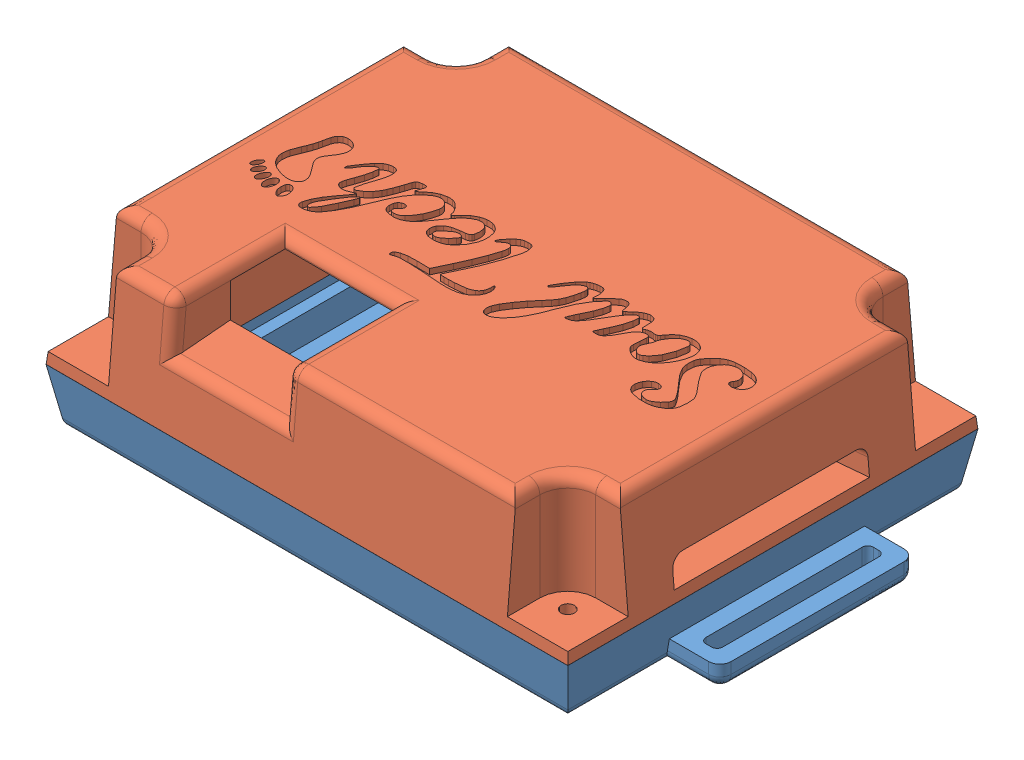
SolidWorks assembly casing.SLDASM, configuration Default (file format 14000). Lengths in mm.
Overall size (109.53 30 73.53).
2 component instances, 2 part files, 3 mates.
Components (placement in the parent):
- bottomcover-1: bottomcover.SLDPRT [Default] at (9.3506 43.5739 109.9385) size (109.53 10 73.53)
- topcover-1: topcover.SLDPRT [Default] at (9.3506 73.5739 109.9385) x (1 0 0) z (0 0 -1) size (93.5 20 73.5)
Mates (geometry in assembly coordinates):
- Concentric2: concentric anti-aligned: circle of bottomcover-1; circle of topcover-1
- Concentric3: concentric anti-aligned: circle of bottomcover-1; circle of topcover-1
- Coincident2: coincident anti-aligned: plane of bottomcover-1 through (9.3506 53.5739 109.9385) normal (0 1 0); plane of topcover-1 through (9.3506 53.5739 109.9385) normal (0 -1 0)
